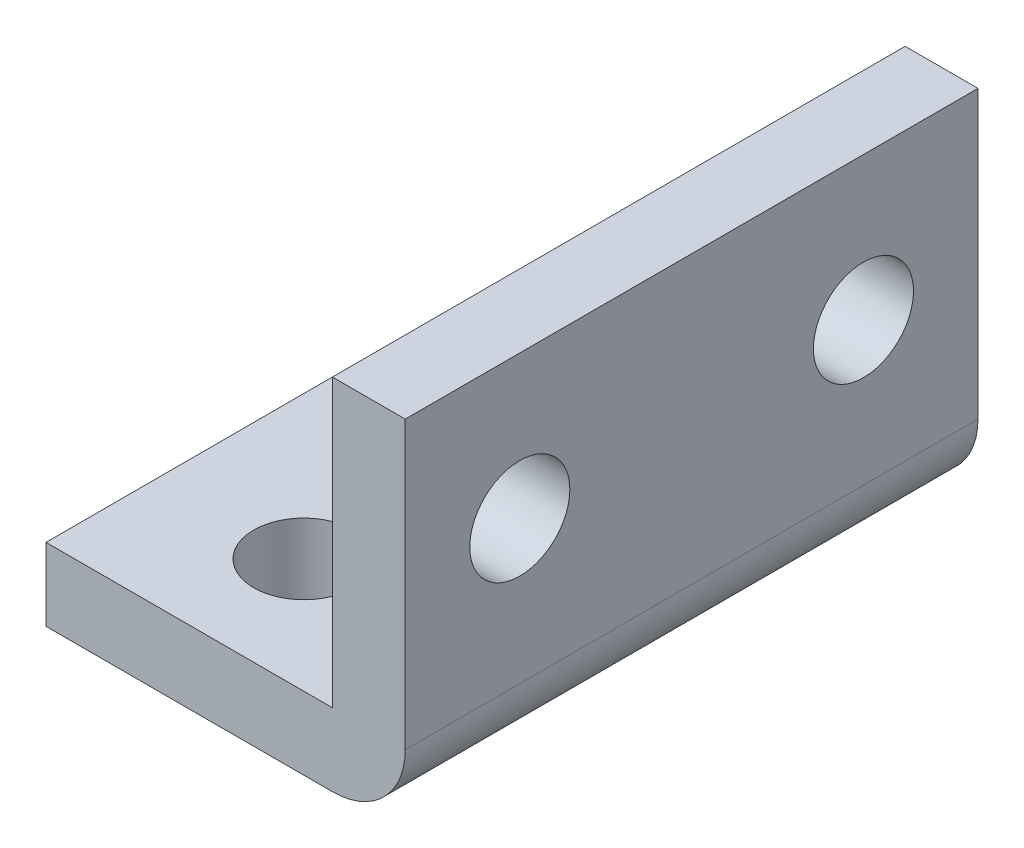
ISO-10303-21;
HEADER;
FILE_DESCRIPTION(('STEP AP214'),'2;1');
FILE_NAME('part.step','',(''),(''),'','','');
FILE_SCHEMA(('AUTOMOTIVE_DESIGN { 1 0 10303 214 1 1 1 1 }'));
ENDSEC;
DATA;
#1=APPLICATION_CONTEXT('core data for automotive mechanical design processes');
#2=APPLICATION_PROTOCOL_DEFINITION('international standard','automotive_design',2000,#1);
#3=PRODUCT_CONTEXT('',#1,'mechanical');
#4=PRODUCT('Part','Part','',(#3));
#5=PRODUCT_RELATED_PRODUCT_CATEGORY('part','',(#4));
#6=PRODUCT_DEFINITION_FORMATION('','',#4);
#7=PRODUCT_DEFINITION_CONTEXT('part definition',#1,'design');
#8=PRODUCT_DEFINITION('design','',#6,#7);
#9=PRODUCT_DEFINITION_SHAPE('','',#8);
#10=(LENGTH_UNIT() NAMED_UNIT(*) SI_UNIT(.MILLI.,.METRE.));
#11=(NAMED_UNIT(*) PLANE_ANGLE_UNIT() SI_UNIT($,.RADIAN.));
#12=(NAMED_UNIT(*) SI_UNIT($,.STERADIAN.) SOLID_ANGLE_UNIT());
#13=UNCERTAINTY_MEASURE_WITH_UNIT(LENGTH_MEASURE(1.E-05),#10,'distance_accuracy_value','');
#14=(GEOMETRIC_REPRESENTATION_CONTEXT(3) GLOBAL_UNCERTAINTY_ASSIGNED_CONTEXT((#13)) GLOBAL_UNIT_ASSIGNED_CONTEXT((#10,
#11,#12)) REPRESENTATION_CONTEXT('',''));
#15=CARTESIAN_POINT('',(0.,0.,0.));
#16=DIRECTION('',(0.,0.,1.));
#17=DIRECTION('',(1.,0.,0.));
#18=AXIS2_PLACEMENT_3D('',#15,#16,#17);
#19=CARTESIAN_POINT('',(0.,3.175,0.));
#20=DIRECTION('',(0.,-1.,0.));
#21=DIRECTION('',(0.,0.,-1.));
#22=AXIS2_PLACEMENT_3D('',#19,#20,#21);
#23=PLANE('',#22);
#24=DIRECTION('',(0.,0.,-1.));
#25=VECTOR('',#24,1.);
#26=CARTESIAN_POINT('',(6.25,3.175,12.5));
#27=LINE('',#26,#25);
#28=CARTESIAN_POINT('',(6.25,3.175,12.5));
#29=VERTEX_POINT('',#28);
#30=CARTESIAN_POINT('',(6.25,3.175,-12.5));
#31=VERTEX_POINT('',#30);
#32=EDGE_CURVE('E145',#29,#31,#27,.T.);
#33=ORIENTED_EDGE('',*,*,#32,.T.);
#34=DIRECTION('',(-1.,0.,0.));
#35=VECTOR('',#34,1.);
#36=CARTESIAN_POINT('',(-6.25,3.175,-12.5));
#37=LINE('',#36,#35);
#38=CARTESIAN_POINT('',(-6.25,3.175,-12.5));
#39=VERTEX_POINT('',#38);
#40=EDGE_CURVE('E106',#31,#39,#37,.T.);
#41=ORIENTED_EDGE('',*,*,#40,.T.);
#42=DIRECTION('',(0.,0.,1.));
#43=VECTOR('',#42,1.);
#44=CARTESIAN_POINT('',(-6.25,3.175,12.5));
#45=LINE('',#44,#43);
#46=CARTESIAN_POINT('',(-6.25,3.175,12.5));
#47=VERTEX_POINT('',#46);
#48=EDGE_CURVE('E149',#39,#47,#45,.T.);
#49=ORIENTED_EDGE('',*,*,#48,.T.);
#50=DIRECTION('',(1.,0.,0.));
#51=VECTOR('',#50,1.);
#52=CARTESIAN_POINT('',(-6.25,3.175,12.5));
#53=LINE('',#52,#51);
#54=EDGE_CURVE('E151',#47,#29,#53,.T.);
#55=ORIENTED_EDGE('',*,*,#54,.T.);
#56=EDGE_LOOP('',(#33,#41,#49,#55));
#57=FACE_BOUND('',#56,.T.);
#58=CARTESIAN_POINT('',(0.,3.175,-7.5));
#59=DIRECTION('',(0.,1.,0.));
#60=DIRECTION('',(0.,0.,1.));
#61=AXIS2_PLACEMENT_3D('',#58,#59,#60);
#62=CIRCLE('',#61,2.1844);
#63=CARTESIAN_POINT('',(0.,3.175,-5.3156));
#64=VERTEX_POINT('',#63);
#65=EDGE_CURVE('E139',#64,#64,#62,.T.);
#66=ORIENTED_EDGE('',*,*,#65,.F.);
#67=EDGE_LOOP('',(#66));
#68=FACE_BOUND('',#67,.T.);
#69=CARTESIAN_POINT('',(0.,3.175,7.5));
#70=DIRECTION('',(0.,1.,0.));
#71=DIRECTION('',(0.,0.,-1.));
#72=AXIS2_PLACEMENT_3D('',#69,#70,#71);
#73=CIRCLE('',#72,2.1844);
#74=CARTESIAN_POINT('',(0.,3.175,5.3156));
#75=VERTEX_POINT('',#74);
#76=EDGE_CURVE('E133',#75,#75,#73,.T.);
#77=ORIENTED_EDGE('',*,*,#76,.F.);
#78=EDGE_LOOP('',(#77));
#79=FACE_BOUND('',#78,.T.);
#80=ADVANCED_FACE('F35',(#57,#68,#79),#23,.F.);
#81=CARTESIAN_POINT('',(0.,0.,0.));
#82=DIRECTION('',(0.,-1.,0.));
#83=DIRECTION('',(0.,0.,-1.));
#84=AXIS2_PLACEMENT_3D('',#81,#82,#83);
#85=PLANE('',#84);
#86=CARTESIAN_POINT('',(0.,0.,-7.5));
#87=DIRECTION('',(0.,1.,0.));
#88=DIRECTION('',(0.,0.,1.));
#89=AXIS2_PLACEMENT_3D('',#86,#87,#88);
#90=CIRCLE('',#89,2.1844);
#91=CARTESIAN_POINT('',(0.,0.,-5.3156));
#92=VERTEX_POINT('',#91);
#93=EDGE_CURVE('E136',#92,#92,#90,.T.);
#94=ORIENTED_EDGE('',*,*,#93,.T.);
#95=EDGE_LOOP('',(#94));
#96=FACE_BOUND('',#95,.T.);
#97=DIRECTION('',(-1.,0.,0.));
#98=VECTOR('',#97,1.);
#99=CARTESIAN_POINT('',(-6.25,0.,-12.5));
#100=LINE('',#99,#98);
#101=CARTESIAN_POINT('',(6.255,0.,-12.5));
#102=VERTEX_POINT('',#101);
#103=CARTESIAN_POINT('',(-6.25,0.,-12.5));
#104=VERTEX_POINT('',#103);
#105=EDGE_CURVE('E142',#102,#104,#100,.T.);
#106=ORIENTED_EDGE('',*,*,#105,.F.);
#107=DIRECTION('',(0.,0.,-1.));
#108=VECTOR('',#107,1.);
#109=CARTESIAN_POINT('',(6.255,0.,12.5));
#110=LINE('',#109,#108);
#111=CARTESIAN_POINT('',(6.255,0.,12.5));
#112=VERTEX_POINT('',#111);
#113=EDGE_CURVE('E43',#102,#112,#110,.F.);
#114=ORIENTED_EDGE('',*,*,#113,.T.);
#115=DIRECTION('',(1.,0.,0.));
#116=VECTOR('',#115,1.);
#117=CARTESIAN_POINT('',(-6.25,0.,12.5));
#118=LINE('',#117,#116);
#119=CARTESIAN_POINT('',(-6.25,0.,12.5));
#120=VERTEX_POINT('',#119);
#121=EDGE_CURVE('E147',#120,#112,#118,.T.);
#122=ORIENTED_EDGE('',*,*,#121,.F.);
#123=DIRECTION('',(0.,0.,1.));
#124=VECTOR('',#123,1.);
#125=CARTESIAN_POINT('',(-6.25,0.,12.5));
#126=LINE('',#125,#124);
#127=EDGE_CURVE('E156',#104,#120,#126,.T.);
#128=ORIENTED_EDGE('',*,*,#127,.F.);
#129=EDGE_LOOP('',(#106,#114,#122,#128));
#130=FACE_BOUND('',#129,.T.);
#131=CARTESIAN_POINT('',(0.,0.,7.5));
#132=DIRECTION('',(0.,1.,0.));
#133=DIRECTION('',(0.,0.,-1.));
#134=AXIS2_PLACEMENT_3D('',#131,#132,#133);
#135=CIRCLE('',#134,2.1844);
#136=CARTESIAN_POINT('',(0.,0.,5.3156));
#137=VERTEX_POINT('',#136);
#138=EDGE_CURVE('E128',#137,#137,#135,.T.);
#139=ORIENTED_EDGE('',*,*,#138,.T.);
#140=EDGE_LOOP('',(#139));
#141=FACE_BOUND('',#140,.T.);
#142=ADVANCED_FACE('F178',(#96,#130,#141),#85,.T.);
#143=CARTESIAN_POINT('',(-6.25,3.175,-12.5));
#144=DIRECTION('',(0.,0.,1.));
#145=DIRECTION('',(1.,0.,0.));
#146=AXIS2_PLACEMENT_3D('',#143,#144,#145);
#147=PLANE('',#146);
#148=DIRECTION('',(0.,-1.,0.));
#149=VECTOR('',#148,1.);
#150=CARTESIAN_POINT('',(9.43,15.675,-12.5));
#151=LINE('',#150,#149);
#152=CARTESIAN_POINT('',(9.43,15.675,-12.5));
#153=VERTEX_POINT('',#152);
#154=CARTESIAN_POINT('',(9.43,3.175,-12.5));
#155=VERTEX_POINT('',#154);
#156=EDGE_CURVE('E109',#153,#155,#151,.T.);
#157=ORIENTED_EDGE('',*,*,#156,.T.);
#158=CARTESIAN_POINT('',(6.255,3.175,-12.5));
#159=DIRECTION('',(0.,0.,1.));
#160=DIRECTION('',(1.,0.,0.));
#161=AXIS2_PLACEMENT_3D('',#158,#159,#160);
#162=CIRCLE('',#161,3.175);
#163=EDGE_CURVE('E57',#155,#102,#162,.F.);
#164=ORIENTED_EDGE('',*,*,#163,.T.);
#165=ORIENTED_EDGE('',*,*,#105,.T.);
#166=DIRECTION('',(0.,-1.,0.));
#167=VECTOR('',#166,1.);
#168=CARTESIAN_POINT('',(-6.25,3.175,-12.5));
#169=LINE('',#168,#167);
#170=EDGE_CURVE('E161',#39,#104,#169,.T.);
#171=ORIENTED_EDGE('',*,*,#170,.F.);
#172=ORIENTED_EDGE('',*,*,#40,.F.);
#173=DIRECTION('',(0.,-1.,0.));
#174=VECTOR('',#173,1.);
#175=CARTESIAN_POINT('',(6.25,15.675,-12.5));
#176=LINE('',#175,#174);
#177=CARTESIAN_POINT('',(6.25,15.675,-12.5));
#178=VERTEX_POINT('',#177);
#179=EDGE_CURVE('E103',#178,#31,#176,.T.);
#180=ORIENTED_EDGE('',*,*,#179,.F.);
#181=DIRECTION('',(-1.,0.,0.));
#182=VECTOR('',#181,1.);
#183=CARTESIAN_POINT('',(9.43,15.675,-12.5));
#184=LINE('',#183,#182);
#185=EDGE_CURVE('E93',#153,#178,#184,.T.);
#186=ORIENTED_EDGE('',*,*,#185,.F.);
#187=EDGE_LOOP('',(#157,#164,#165,#171,#172,#180,#186));
#188=FACE_BOUND('',#187,.T.);
#189=ADVANCED_FACE('F104',(#188),#147,.F.);
#190=CARTESIAN_POINT('',(-6.25,3.175,12.5));
#191=DIRECTION('',(1.,0.,0.));
#192=DIRECTION('',(0.,0.,-1.));
#193=AXIS2_PLACEMENT_3D('',#190,#191,#192);
#194=PLANE('',#193);
#195=ORIENTED_EDGE('',*,*,#127,.T.);
#196=DIRECTION('',(0.,-1.,0.));
#197=VECTOR('',#196,1.);
#198=CARTESIAN_POINT('',(-6.25,3.175,12.5));
#199=LINE('',#198,#197);
#200=EDGE_CURVE('E154',#47,#120,#199,.T.);
#201=ORIENTED_EDGE('',*,*,#200,.F.);
#202=ORIENTED_EDGE('',*,*,#48,.F.);
#203=ORIENTED_EDGE('',*,*,#170,.T.);
#204=EDGE_LOOP('',(#195,#201,#202,#203));
#205=FACE_BOUND('',#204,.T.);
#206=ADVANCED_FACE('F181',(#205),#194,.F.);
#207=CARTESIAN_POINT('',(-6.25,3.175,12.5));
#208=DIRECTION('',(0.,0.,-1.));
#209=DIRECTION('',(-1.,0.,0.));
#210=AXIS2_PLACEMENT_3D('',#207,#208,#209);
#211=PLANE('',#210);
#212=ORIENTED_EDGE('',*,*,#121,.T.);
#213=CARTESIAN_POINT('',(6.255,3.175,12.5));
#214=DIRECTION('',(0.,0.,-1.));
#215=DIRECTION('',(-1.,0.,0.));
#216=AXIS2_PLACEMENT_3D('',#213,#214,#215);
#217=CIRCLE('',#216,3.175);
#218=CARTESIAN_POINT('',(9.43,3.175,12.5));
#219=VERTEX_POINT('',#218);
#220=EDGE_CURVE('E11',#112,#219,#217,.F.);
#221=ORIENTED_EDGE('',*,*,#220,.T.);
#222=DIRECTION('',(0.,-1.,0.));
#223=VECTOR('',#222,1.);
#224=CARTESIAN_POINT('',(9.43,15.675,12.5));
#225=LINE('',#224,#223);
#226=CARTESIAN_POINT('',(9.43,15.675,12.5));
#227=VERTEX_POINT('',#226);
#228=EDGE_CURVE('E129',#227,#219,#225,.T.);
#229=ORIENTED_EDGE('',*,*,#228,.F.);
#230=DIRECTION('',(1.,0.,0.));
#231=VECTOR('',#230,1.);
#232=CARTESIAN_POINT('',(6.25,15.675,12.5));
#233=LINE('',#232,#231);
#234=CARTESIAN_POINT('',(6.25,15.675,12.5));
#235=VERTEX_POINT('',#234);
#236=EDGE_CURVE('E110',#235,#227,#233,.T.);
#237=ORIENTED_EDGE('',*,*,#236,.F.);
#238=DIRECTION('',(0.,-1.,0.));
#239=VECTOR('',#238,1.);
#240=CARTESIAN_POINT('',(6.25,15.675,12.5));
#241=LINE('',#240,#239);
#242=EDGE_CURVE('E114',#235,#29,#241,.T.);
#243=ORIENTED_EDGE('',*,*,#242,.T.);
#244=ORIENTED_EDGE('',*,*,#54,.F.);
#245=ORIENTED_EDGE('',*,*,#200,.T.);
#246=EDGE_LOOP('',(#212,#221,#229,#237,#243,#244,#245));
#247=FACE_BOUND('',#246,.T.);
#248=ADVANCED_FACE('F174',(#247),#211,.F.);
#249=CARTESIAN_POINT('',(0.,3.175,-7.5));
#250=DIRECTION('',(0.,-1.,0.));
#251=DIRECTION('',(0.,0.,-1.));
#252=AXIS2_PLACEMENT_3D('',#249,#250,#251);
#253=CYLINDRICAL_SURFACE('',#252,2.1844);
#254=ORIENTED_EDGE('',*,*,#65,.T.);
#255=EDGE_LOOP('',(#254));
#256=FACE_BOUND('',#255,.T.);
#257=ORIENTED_EDGE('',*,*,#93,.F.);
#258=EDGE_LOOP('',(#257));
#259=FACE_BOUND('',#258,.T.);
#260=ADVANCED_FACE('F194',(#256,#259),#253,.F.);
#261=CARTESIAN_POINT('',(0.,3.175,7.5));
#262=DIRECTION('',(0.,-1.,0.));
#263=DIRECTION('',(0.,0.,-1.));
#264=AXIS2_PLACEMENT_3D('',#261,#262,#263);
#265=CYLINDRICAL_SURFACE('',#264,2.1844);
#266=ORIENTED_EDGE('',*,*,#76,.T.);
#267=EDGE_LOOP('',(#266));
#268=FACE_BOUND('',#267,.T.);
#269=ORIENTED_EDGE('',*,*,#138,.F.);
#270=EDGE_LOOP('',(#269));
#271=FACE_BOUND('',#270,.T.);
#272=ADVANCED_FACE('F191',(#268,#271),#265,.F.);
#273=CARTESIAN_POINT('',(6.25,15.675,12.5));
#274=DIRECTION('',(-1.,0.,0.));
#275=DIRECTION('',(0.,0.,1.));
#276=AXIS2_PLACEMENT_3D('',#273,#274,#275);
#277=PLANE('',#276);
#278=CARTESIAN_POINT('',(6.25,9.425,-7.5));
#279=DIRECTION('',(-1.,0.,0.));
#280=DIRECTION('',(0.,0.,1.));
#281=AXIS2_PLACEMENT_3D('',#278,#279,#280);
#282=CIRCLE('',#281,2.1844);
#283=CARTESIAN_POINT('',(6.25,9.425,-5.3156));
#284=VERTEX_POINT('',#283);
#285=EDGE_CURVE('E119',#284,#284,#282,.T.);
#286=ORIENTED_EDGE('',*,*,#285,.F.);
#287=EDGE_LOOP('',(#286));
#288=FACE_BOUND('',#287,.T.);
#289=CARTESIAN_POINT('',(6.25,9.425,7.5));
#290=DIRECTION('',(-1.,0.,0.));
#291=DIRECTION('',(0.,0.,-1.));
#292=AXIS2_PLACEMENT_3D('',#289,#290,#291);
#293=CIRCLE('',#292,2.1844);
#294=CARTESIAN_POINT('',(6.25,9.425,5.3156));
#295=VERTEX_POINT('',#294);
#296=EDGE_CURVE('E122',#295,#295,#293,.T.);
#297=ORIENTED_EDGE('',*,*,#296,.F.);
#298=EDGE_LOOP('',(#297));
#299=FACE_BOUND('',#298,.T.);
#300=ORIENTED_EDGE('',*,*,#32,.F.);
#301=ORIENTED_EDGE('',*,*,#242,.F.);
#302=DIRECTION('',(0.,0.,-1.));
#303=VECTOR('',#302,1.);
#304=CARTESIAN_POINT('',(6.25,15.675,12.5));
#305=LINE('',#304,#303);
#306=EDGE_CURVE('E97',#235,#178,#305,.T.);
#307=ORIENTED_EDGE('',*,*,#306,.T.);
#308=ORIENTED_EDGE('',*,*,#179,.T.);
#309=EDGE_LOOP('',(#300,#301,#307,#308));
#310=FACE_BOUND('',#309,.T.);
#311=ADVANCED_FACE('F112',(#288,#299,#310),#277,.T.);
#312=CARTESIAN_POINT('',(9.43,15.675,12.5));
#313=DIRECTION('',(-1.,0.,0.));
#314=DIRECTION('',(0.,0.,1.));
#315=AXIS2_PLACEMENT_3D('',#312,#313,#314);
#316=PLANE('',#315);
#317=CARTESIAN_POINT('',(9.43,9.425,-7.5));
#318=DIRECTION('',(-1.,0.,0.));
#319=DIRECTION('',(0.,0.,1.));
#320=AXIS2_PLACEMENT_3D('',#317,#318,#319);
#321=CIRCLE('',#320,2.1844);
#322=CARTESIAN_POINT('',(9.43,9.425,-5.3156));
#323=VERTEX_POINT('',#322);
#324=EDGE_CURVE('E116',#323,#323,#321,.T.);
#325=ORIENTED_EDGE('',*,*,#324,.T.);
#326=EDGE_LOOP('',(#325));
#327=FACE_BOUND('',#326,.T.);
#328=CARTESIAN_POINT('',(9.43,9.425,7.5));
#329=DIRECTION('',(-1.,0.,0.));
#330=DIRECTION('',(0.,0.,-1.));
#331=AXIS2_PLACEMENT_3D('',#328,#329,#330);
#332=CIRCLE('',#331,2.1844);
#333=CARTESIAN_POINT('',(9.43,9.425,5.3156));
#334=VERTEX_POINT('',#333);
#335=EDGE_CURVE('E316',#334,#334,#332,.T.);
#336=ORIENTED_EDGE('',*,*,#335,.T.);
#337=EDGE_LOOP('',(#336));
#338=FACE_BOUND('',#337,.T.);
#339=ORIENTED_EDGE('',*,*,#228,.T.);
#340=DIRECTION('',(0.,0.,-1.));
#341=VECTOR('',#340,1.);
#342=CARTESIAN_POINT('',(9.43,3.175,-12.5));
#343=LINE('',#342,#341);
#344=EDGE_CURVE('E164',#219,#155,#343,.T.);
#345=ORIENTED_EDGE('',*,*,#344,.T.);
#346=ORIENTED_EDGE('',*,*,#156,.F.);
#347=DIRECTION('',(0.,0.,1.));
#348=VECTOR('',#347,1.);
#349=CARTESIAN_POINT('',(9.43,15.675,12.5));
#350=LINE('',#349,#348);
#351=EDGE_CURVE('E99',#227,#153,#350,.F.);
#352=ORIENTED_EDGE('',*,*,#351,.F.);
#353=EDGE_LOOP('',(#339,#345,#346,#352));
#354=FACE_BOUND('',#353,.T.);
#355=ADVANCED_FACE('F169',(#327,#338,#354),#316,.F.);
#356=CARTESIAN_POINT('',(0.,15.675,0.));
#357=DIRECTION('',(0.,1.,0.));
#358=DIRECTION('',(-1.,0.,0.));
#359=AXIS2_PLACEMENT_3D('',#356,#357,#358);
#360=PLANE('',#359);
#361=ORIENTED_EDGE('',*,*,#306,.F.);
#362=ORIENTED_EDGE('',*,*,#236,.T.);
#363=ORIENTED_EDGE('',*,*,#351,.T.);
#364=ORIENTED_EDGE('',*,*,#185,.T.);
#365=EDGE_LOOP('',(#361,#362,#363,#364));
#366=FACE_BOUND('',#365,.T.);
#367=ADVANCED_FACE('F95',(#366),#360,.T.);
#368=CARTESIAN_POINT('',(9.43,9.425,7.5));
#369=DIRECTION('',(-1.,0.,0.));
#370=DIRECTION('',(0.,0.,1.));
#371=AXIS2_PLACEMENT_3D('',#368,#369,#370);
#372=CYLINDRICAL_SURFACE('',#371,2.1844);
#373=ORIENTED_EDGE('',*,*,#335,.F.);
#374=EDGE_LOOP('',(#373));
#375=FACE_BOUND('',#374,.T.);
#376=ORIENTED_EDGE('',*,*,#296,.T.);
#377=EDGE_LOOP('',(#376));
#378=FACE_BOUND('',#377,.T.);
#379=ADVANCED_FACE('F249',(#375,#378),#372,.F.);
#380=CARTESIAN_POINT('',(9.43,9.425,-7.5));
#381=DIRECTION('',(-1.,0.,0.));
#382=DIRECTION('',(0.,0.,1.));
#383=AXIS2_PLACEMENT_3D('',#380,#381,#382);
#384=CYLINDRICAL_SURFACE('',#383,2.1844);
#385=ORIENTED_EDGE('',*,*,#324,.F.);
#386=EDGE_LOOP('',(#385));
#387=FACE_BOUND('',#386,.T.);
#388=ORIENTED_EDGE('',*,*,#285,.T.);
#389=EDGE_LOOP('',(#388));
#390=FACE_BOUND('',#389,.T.);
#391=ADVANCED_FACE('F255',(#387,#390),#384,.F.);
#392=CARTESIAN_POINT('',(6.255,3.175,12.5));
#393=DIRECTION('',(0.,0.,1.));
#394=DIRECTION('',(1.,0.,0.));
#395=AXIS2_PLACEMENT_3D('',#392,#393,#394);
#396=CYLINDRICAL_SURFACE('',#395,3.175);
#397=ORIENTED_EDGE('',*,*,#220,.F.);
#398=ORIENTED_EDGE('',*,*,#113,.F.);
#399=ORIENTED_EDGE('',*,*,#163,.F.);
#400=ORIENTED_EDGE('',*,*,#344,.F.);
#401=EDGE_LOOP('',(#397,#398,#399,#400));
#402=FACE_BOUND('',#401,.T.);
#403=ADVANCED_FACE('F37',(#402),#396,.T.);
#404=CLOSED_SHELL('',(#80,#142,#189,#206,#248,#260,#272,#311,#355,#367,#379,#391,#403));
#405=MANIFOLD_SOLID_BREP('B2',#404);
#406=ADVANCED_BREP_SHAPE_REPRESENTATION('',(#18,#405),#14);
#407=SHAPE_DEFINITION_REPRESENTATION(#9,#406);
ENDSEC;
END-ISO-10303-21;
